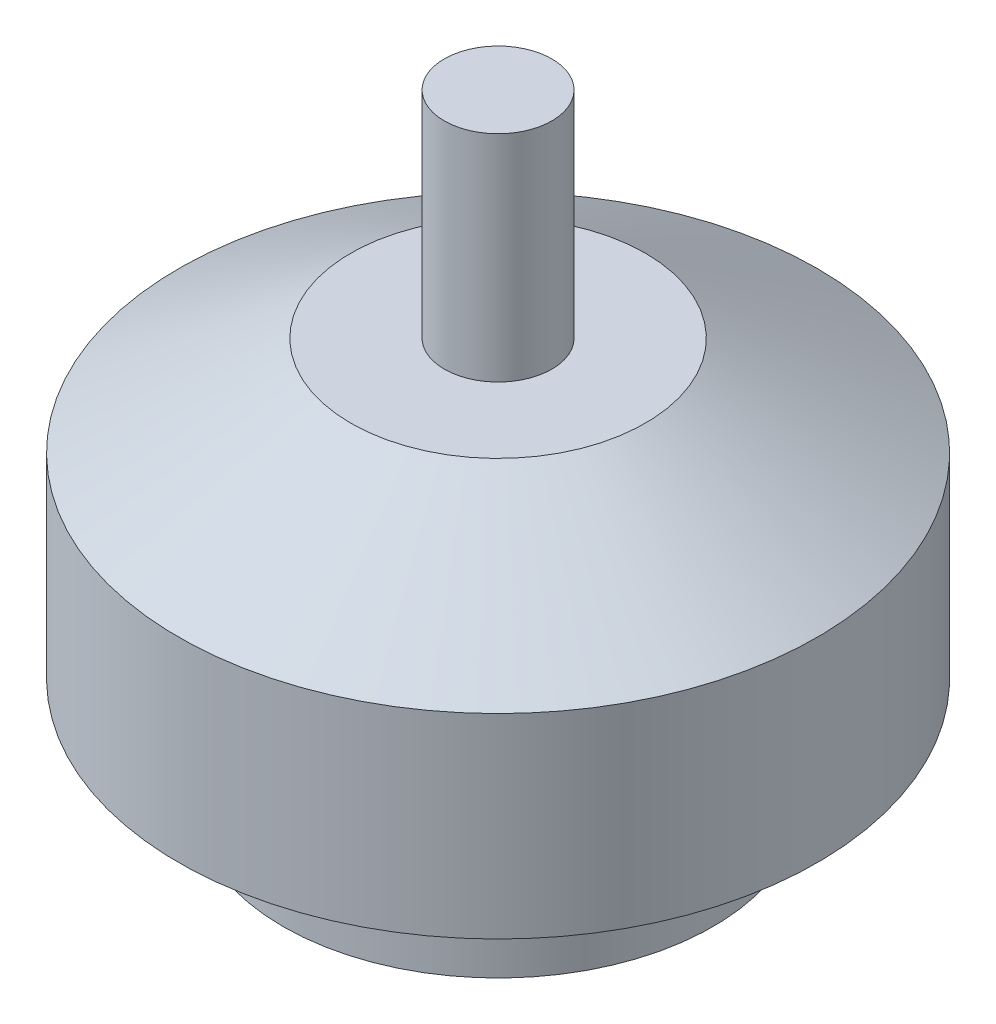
from build123d import *

# Parameters (mm, degrees)
SKETCH1_R           = 10
BOSS_EXTRUDE1_DEPTH = 5
SKETCH2_R           = 14.85
BOSS_EXTRUDE2_DEPTH = 13.7
CHAMFER1_SIZE       = 8
CHAMFER1_SIZE2      = 4.618802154
SKETCH3_R           = 2.5
BOSS_EXTRUDE3_DEPTH = 10


with BuildPart() as part:
    # Sketch1 → Boss-Extrude1 (new body)
    with BuildSketch(Plane(origin=(0, 0, 0), x_dir=(1, 0, 0), z_dir=(0, 1, 0))):
        with Locations(Location((0, 0, 0), (0, 0, 270))):
            Circle(SKETCH1_R)
    extrude(amount=BOSS_EXTRUDE1_DEPTH)

    # Sketch2 → Boss-Extrude2 (add)
    with BuildSketch(Plane(origin=(0, 5, 0), x_dir=(1, 0, 0), z_dir=(0, 1, 0))):
        with Locations(Location((0, 0, 0), (0, 0, 90))):
            Circle(SKETCH2_R)
    extrude(amount=BOSS_EXTRUDE2_DEPTH)

    # Chamfer1
    chamfer1_edges = [part.edges().sort_by_distance(p)[0] for p in [
        (0, 18.7, 14.85),
    ]]
    chamfer1_side = [part.faces().sort_by_distance(p)[0] for p in [
        (0, 18.7, 0),
    ]]
    chamfer(chamfer1_edges, length=CHAMFER1_SIZE, length2=CHAMFER1_SIZE2, reference=chamfer1_side[0])

    # Sketch3 → Boss-Extrude3 (add)
    with BuildSketch(Plane(origin=(0, 18.7, 0), x_dir=(1, 0, 0), z_dir=(0, 1, 0))):
        with Locations(Location((0, 0, 0), (0, 0, 270))):
            Circle(SKETCH3_R)
    extrude(amount=BOSS_EXTRUDE3_DEPTH)


solid = part.part
